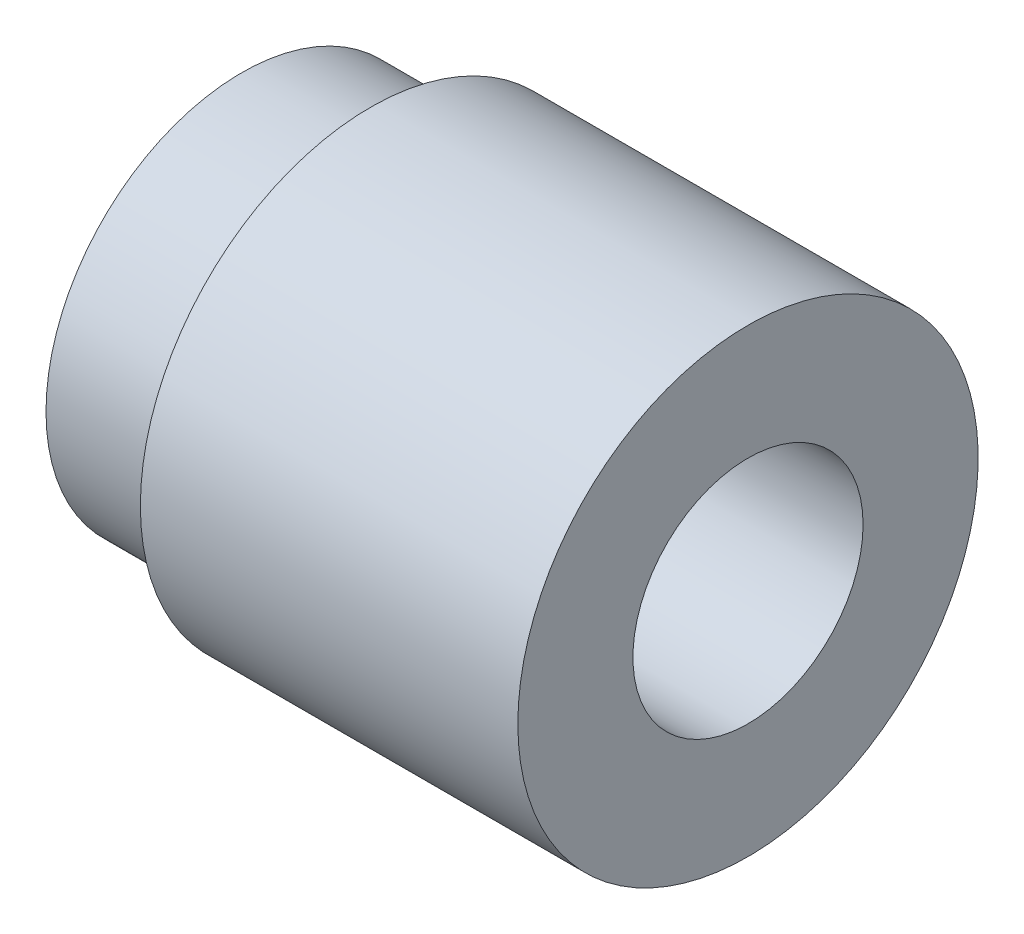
ISO-10303-21;
HEADER;
FILE_DESCRIPTION(('STEP AP214'),'2;1');
FILE_NAME('part.step','',(''),(''),'','','');
FILE_SCHEMA(('AUTOMOTIVE_DESIGN { 1 0 10303 214 1 1 1 1 }'));
ENDSEC;
DATA;
#1=APPLICATION_CONTEXT('core data for automotive mechanical design processes');
#2=APPLICATION_PROTOCOL_DEFINITION('international standard','automotive_design',2000,#1);
#3=PRODUCT_CONTEXT('',#1,'mechanical');
#4=PRODUCT('Part','Part','',(#3));
#5=PRODUCT_RELATED_PRODUCT_CATEGORY('part','',(#4));
#6=PRODUCT_DEFINITION_FORMATION('','',#4);
#7=PRODUCT_DEFINITION_CONTEXT('part definition',#1,'design');
#8=PRODUCT_DEFINITION('design','',#6,#7);
#9=PRODUCT_DEFINITION_SHAPE('','',#8);
#10=(LENGTH_UNIT() NAMED_UNIT(*) SI_UNIT(.MILLI.,.METRE.));
#11=(NAMED_UNIT(*) PLANE_ANGLE_UNIT() SI_UNIT($,.RADIAN.));
#12=(NAMED_UNIT(*) SI_UNIT($,.STERADIAN.) SOLID_ANGLE_UNIT());
#13=UNCERTAINTY_MEASURE_WITH_UNIT(LENGTH_MEASURE(1.E-05),#10,'distance_accuracy_value','');
#14=(GEOMETRIC_REPRESENTATION_CONTEXT(3) GLOBAL_UNCERTAINTY_ASSIGNED_CONTEXT((#13)) GLOBAL_UNIT_ASSIGNED_CONTEXT((#10,
#11,#12)) REPRESENTATION_CONTEXT('',''));
#15=CARTESIAN_POINT('',(0.,0.,0.));
#16=DIRECTION('',(0.,0.,1.));
#17=DIRECTION('',(1.,0.,0.));
#18=AXIS2_PLACEMENT_3D('',#15,#16,#17);
#19=CARTESIAN_POINT('',(-0.158997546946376,0.,0.));
#20=DIRECTION('',(-1.,0.,0.));
#21=DIRECTION('',(0.,0.,1.));
#22=AXIS2_PLACEMENT_3D('',#19,#20,#21);
#23=CYLINDRICAL_SURFACE('',#22,2.125);
#24=CARTESIAN_POINT('',(0.,0.,0.));
#25=DIRECTION('',(-1.,0.,0.));
#26=DIRECTION('',(0.,0.,1.));
#27=AXIS2_PLACEMENT_3D('',#24,#25,#26);
#28=CIRCLE('',#27,2.125);
#29=CARTESIAN_POINT('',(0.,0.,2.125));
#30=VERTEX_POINT('',#29);
#31=EDGE_CURVE('E10',#30,#30,#28,.T.);
#32=ORIENTED_EDGE('',*,*,#31,.F.);
#33=EDGE_LOOP('',(#32));
#34=FACE_BOUND('',#33,.T.);
#35=CARTESIAN_POINT('',(1.4,0.,0.));
#36=DIRECTION('',(-1.,0.,0.));
#37=DIRECTION('',(0.,0.,1.));
#38=AXIS2_PLACEMENT_3D('',#35,#36,#37);
#39=CIRCLE('',#38,2.125);
#40=CARTESIAN_POINT('',(1.4,0.,2.125));
#41=VERTEX_POINT('',#40);
#42=EDGE_CURVE('E59',#41,#41,#39,.T.);
#43=ORIENTED_EDGE('',*,*,#42,.T.);
#44=EDGE_LOOP('',(#43));
#45=FACE_BOUND('',#44,.T.);
#46=ADVANCED_FACE('F40',(#34,#45),#23,.T.);
#47=CARTESIAN_POINT('',(0.,0.,0.));
#48=DIRECTION('',(1.,0.,0.));
#49=DIRECTION('',(0.,0.,-1.));
#50=AXIS2_PLACEMENT_3D('',#47,#48,#49);
#51=PLANE('',#50);
#52=CARTESIAN_POINT('',(0.,0.,0.));
#53=DIRECTION('',(1.,0.,0.));
#54=DIRECTION('',(0.,0.,-1.));
#55=AXIS2_PLACEMENT_3D('',#52,#53,#54);
#56=CIRCLE('',#55,1.25);
#57=CARTESIAN_POINT('',(0.,0.,-1.25));
#58=VERTEX_POINT('',#57);
#59=EDGE_CURVE('E65',#58,#58,#56,.T.);
#60=ORIENTED_EDGE('',*,*,#59,.T.);
#61=EDGE_LOOP('',(#60));
#62=FACE_BOUND('',#61,.T.);
#63=ORIENTED_EDGE('',*,*,#31,.T.);
#64=EDGE_LOOP('',(#63));
#65=FACE_BOUND('',#64,.T.);
#66=ADVANCED_FACE('F78',(#62,#65),#51,.F.);
#67=CARTESIAN_POINT('',(5.5,2.5,0.));
#68=DIRECTION('',(-1.,0.,0.));
#69=DIRECTION('',(0.,0.,1.));
#70=AXIS2_PLACEMENT_3D('',#67,#68,#69);
#71=PLANE('',#70);
#72=CARTESIAN_POINT('',(5.5,0.,0.));
#73=DIRECTION('',(1.,0.,0.));
#74=DIRECTION('',(0.,0.,-1.));
#75=AXIS2_PLACEMENT_3D('',#72,#73,#74);
#76=CIRCLE('',#75,1.25);
#77=CARTESIAN_POINT('',(5.5,0.,-1.25));
#78=VERTEX_POINT('',#77);
#79=EDGE_CURVE('E68',#78,#78,#76,.T.);
#80=ORIENTED_EDGE('',*,*,#79,.F.);
#81=EDGE_LOOP('',(#80));
#82=FACE_BOUND('',#81,.T.);
#83=CARTESIAN_POINT('',(5.5,0.,0.));
#84=DIRECTION('',(-1.,0.,0.));
#85=DIRECTION('',(0.,0.,1.));
#86=AXIS2_PLACEMENT_3D('',#83,#84,#85);
#87=CIRCLE('',#86,2.5);
#88=CARTESIAN_POINT('',(5.5,0.,2.5));
#89=VERTEX_POINT('',#88);
#90=EDGE_CURVE('E47',#89,#89,#87,.T.);
#91=ORIENTED_EDGE('',*,*,#90,.F.);
#92=EDGE_LOOP('',(#91));
#93=FACE_BOUND('',#92,.T.);
#94=ADVANCED_FACE('F74',(#82,#93),#71,.F.);
#95=CARTESIAN_POINT('',(-0.158997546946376,0.,0.));
#96=DIRECTION('',(-1.,0.,0.));
#97=DIRECTION('',(0.,0.,1.));
#98=AXIS2_PLACEMENT_3D('',#95,#96,#97);
#99=CYLINDRICAL_SURFACE('',#98,2.5);
#100=CARTESIAN_POINT('',(1.4,0.,0.));
#101=DIRECTION('',(-1.,0.,0.));
#102=DIRECTION('',(0.,0.,1.));
#103=AXIS2_PLACEMENT_3D('',#100,#101,#102);
#104=CIRCLE('',#103,2.5);
#105=CARTESIAN_POINT('',(1.4,0.,2.5));
#106=VERTEX_POINT('',#105);
#107=EDGE_CURVE('E54',#106,#106,#104,.T.);
#108=ORIENTED_EDGE('',*,*,#107,.F.);
#109=EDGE_LOOP('',(#108));
#110=FACE_BOUND('',#109,.T.);
#111=ORIENTED_EDGE('',*,*,#90,.T.);
#112=EDGE_LOOP('',(#111));
#113=FACE_BOUND('',#112,.T.);
#114=ADVANCED_FACE('F77',(#110,#113),#99,.T.);
#115=CARTESIAN_POINT('',(1.4,2.125,0.));
#116=DIRECTION('',(1.,0.,0.));
#117=DIRECTION('',(0.,0.,-1.));
#118=AXIS2_PLACEMENT_3D('',#115,#116,#117);
#119=PLANE('',#118);
#120=ORIENTED_EDGE('',*,*,#42,.F.);
#121=EDGE_LOOP('',(#120));
#122=FACE_BOUND('',#121,.T.);
#123=ORIENTED_EDGE('',*,*,#107,.T.);
#124=EDGE_LOOP('',(#123));
#125=FACE_BOUND('',#124,.T.);
#126=ADVANCED_FACE('F84',(#122,#125),#119,.F.);
#127=CARTESIAN_POINT('',(5.5,0.,0.));
#128=DIRECTION('',(1.,0.,0.));
#129=DIRECTION('',(0.,0.,-1.));
#130=AXIS2_PLACEMENT_3D('',#127,#128,#129);
#131=CYLINDRICAL_SURFACE('',#130,1.25);
#132=ORIENTED_EDGE('',*,*,#59,.F.);
#133=EDGE_LOOP('',(#132));
#134=FACE_BOUND('',#133,.T.);
#135=ORIENTED_EDGE('',*,*,#79,.T.);
#136=EDGE_LOOP('',(#135));
#137=FACE_BOUND('',#136,.T.);
#138=ADVANCED_FACE('F72',(#134,#137),#131,.F.);
#139=CLOSED_SHELL('',(#46,#66,#94,#114,#126,#138));
#140=MANIFOLD_SOLID_BREP('B2',#139);
#141=ADVANCED_BREP_SHAPE_REPRESENTATION('',(#18,#140),#14);
#142=SHAPE_DEFINITION_REPRESENTATION(#9,#141);
ENDSEC;
END-ISO-10303-21;
